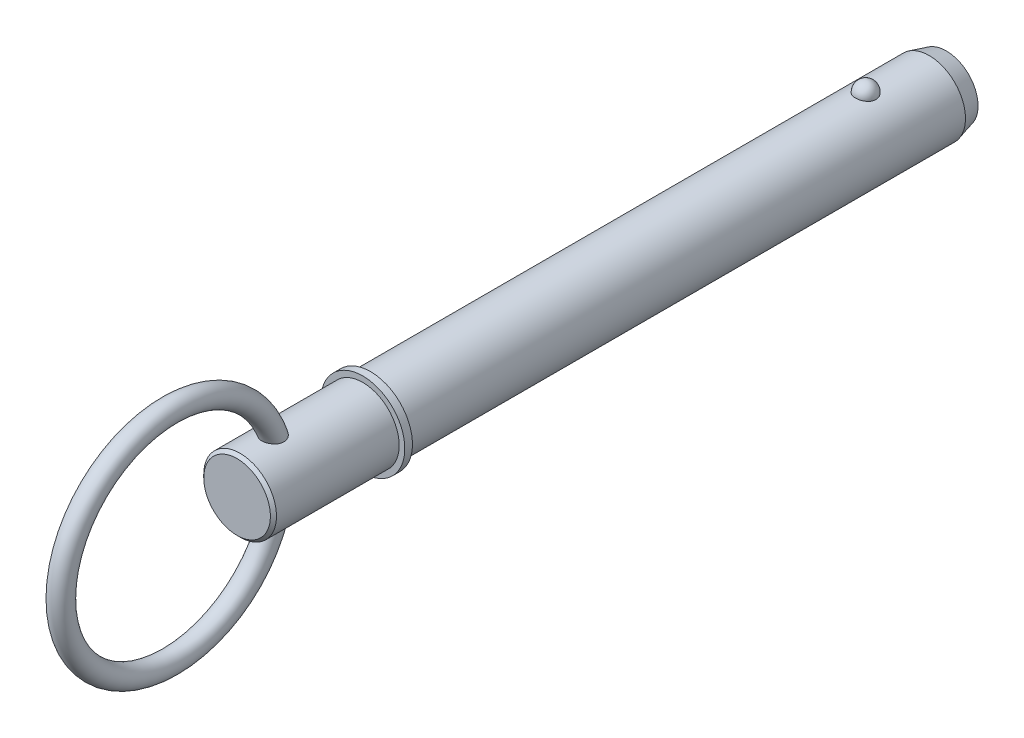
ISO-10303-21;
HEADER;
FILE_DESCRIPTION(('STEP AP214'),'2;1');
FILE_NAME('part.step','',(''),(''),'','','');
FILE_SCHEMA(('AUTOMOTIVE_DESIGN { 1 0 10303 214 1 1 1 1 }'));
ENDSEC;
DATA;
#1=APPLICATION_CONTEXT('core data for automotive mechanical design processes');
#2=APPLICATION_PROTOCOL_DEFINITION('international standard','automotive_design',2000,#1);
#3=PRODUCT_CONTEXT('',#1,'mechanical');
#4=PRODUCT('Part','Part','',(#3));
#5=PRODUCT_RELATED_PRODUCT_CATEGORY('part','',(#4));
#6=PRODUCT_DEFINITION_FORMATION('','',#4);
#7=PRODUCT_DEFINITION_CONTEXT('part definition',#1,'design');
#8=PRODUCT_DEFINITION('design','',#6,#7);
#9=PRODUCT_DEFINITION_SHAPE('','',#8);
#10=(LENGTH_UNIT() NAMED_UNIT(*) SI_UNIT(.MILLI.,.METRE.));
#11=(NAMED_UNIT(*) PLANE_ANGLE_UNIT() SI_UNIT($,.RADIAN.));
#12=(NAMED_UNIT(*) SI_UNIT($,.STERADIAN.) SOLID_ANGLE_UNIT());
#13=UNCERTAINTY_MEASURE_WITH_UNIT(LENGTH_MEASURE(1.E-05),#10,'distance_accuracy_value','');
#14=(GEOMETRIC_REPRESENTATION_CONTEXT(3) GLOBAL_UNCERTAINTY_ASSIGNED_CONTEXT((#13)) GLOBAL_UNIT_ASSIGNED_CONTEXT((#10,
#11,#12)) REPRESENTATION_CONTEXT('',''));
#15=CARTESIAN_POINT('',(0.,0.,0.));
#16=DIRECTION('',(0.,0.,1.));
#17=DIRECTION('',(1.,0.,0.));
#18=AXIS2_PLACEMENT_3D('',#15,#16,#17);
#19=CARTESIAN_POINT('',(0.,0.,127.));
#20=DIRECTION('',(0.,0.,-1.));
#21=DIRECTION('',(-1.,0.,0.));
#22=AXIS2_PLACEMENT_3D('',#19,#20,#21);
#23=CYLINDRICAL_SURFACE('',#22,9.525);
#24=CARTESIAN_POINT('',(2.66304631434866,9.14515223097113,-2.68999999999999));
#25=CARTESIAN_POINT('',(2.66304388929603,9.14515434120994,-2.53964785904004));
#26=CARTESIAN_POINT('',(2.65079171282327,9.14874785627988,-2.38926509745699));
#27=CARTESIAN_POINT('',(2.60207590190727,9.16272073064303,-2.09276319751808));
#28=CARTESIAN_POINT('',(2.5656035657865,9.17310252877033,-1.94664561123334));
#29=CARTESIAN_POINT('',(2.469373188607,9.19947238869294,-1.66290124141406));
#30=CARTESIAN_POINT('',(2.40962536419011,9.215457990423,-1.52527076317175));
#31=CARTESIAN_POINT('',(2.26832639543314,9.25124900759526,-1.26225231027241));
#32=CARTESIAN_POINT('',(2.1867756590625,9.27105435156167,-1.13686410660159));
#33=CARTESIAN_POINT('',(2.00344089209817,9.3123948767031,-0.901158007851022));
#34=CARTESIAN_POINT('',(1.90155748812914,9.33393823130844,-0.790918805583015));
#35=CARTESIAN_POINT('',(1.68043702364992,9.37626794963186,-0.589299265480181));
#36=CARTESIAN_POINT('',(1.56119995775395,9.397054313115,-0.497918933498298));
#37=CARTESIAN_POINT('',(1.30893044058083,9.43549335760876,-0.336812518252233));
#38=CARTESIAN_POINT('',(1.17593917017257,9.45315498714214,-0.267024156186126));
#39=CARTESIAN_POINT('',(0.8995966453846,9.48344056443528,-0.150749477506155));
#40=CARTESIAN_POINT('',(0.756246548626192,9.49606507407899,-0.104260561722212));
#41=CARTESIAN_POINT('',(0.466048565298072,9.51468193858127,-0.0365733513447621));
#42=CARTESIAN_POINT('',(0.319312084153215,9.52079100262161,-0.014929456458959));
#43=CARTESIAN_POINT('',(0.0241592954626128,9.52611235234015,0.00395337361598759));
#44=CARTESIAN_POINT('',(-0.124256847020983,9.5253253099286,0.00119468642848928));
#45=CARTESIAN_POINT('',(-0.41628168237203,9.51700443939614,-0.0284230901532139));
#46=CARTESIAN_POINT('',(-0.559928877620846,9.50956858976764,-0.0549321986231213));
#47=CARTESIAN_POINT('',(-0.840604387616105,9.48887888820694,-0.130816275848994));
#48=CARTESIAN_POINT('',(-0.977632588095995,9.47562493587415,-0.180191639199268));
#49=CARTESIAN_POINT('',(-1.24212223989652,9.44460733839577,-0.300803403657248));
#50=CARTESIAN_POINT('',(-1.36952298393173,9.42681774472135,-0.372166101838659));
#51=CARTESIAN_POINT('',(-1.61053183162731,9.38864858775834,-0.534729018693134));
#52=CARTESIAN_POINT('',(-1.72413851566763,9.36826875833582,-0.625931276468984));
#53=CARTESIAN_POINT('',(-1.9367483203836,9.32666137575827,-0.827716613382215));
#54=CARTESIAN_POINT('',(-2.03542624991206,9.3054250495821,-0.938640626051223));
#55=CARTESIAN_POINT('',(-2.21301001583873,9.26480083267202,-1.17562728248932));
#56=CARTESIAN_POINT('',(-2.29191442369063,9.24541307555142,-1.3016910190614));
#57=CARTESIAN_POINT('',(-2.4288038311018,9.21040769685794,-1.56709947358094));
#58=CARTESIAN_POINT('',(-2.48653332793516,9.19483682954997,-1.70658229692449));
#59=CARTESIAN_POINT('',(-2.57830950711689,9.16952722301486,-1.99363485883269));
#60=CARTESIAN_POINT('',(-2.61235688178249,9.1597883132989,-2.14120436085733));
#61=CARTESIAN_POINT('',(-2.65582131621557,9.14728131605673,-2.43957517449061));
#62=CARTESIAN_POINT('',(-2.66534248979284,9.14448376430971,-2.59036007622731));
#63=CARTESIAN_POINT('',(-2.659816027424,9.1460926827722,-2.89143694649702));
#64=CARTESIAN_POINT('',(-2.64476907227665,9.15049895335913,-3.04172892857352));
#65=CARTESIAN_POINT('',(-2.59062526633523,9.16597303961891,-3.3367616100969));
#66=CARTESIAN_POINT('',(-2.55165119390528,9.17700684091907,-3.48152666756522));
#67=CARTESIAN_POINT('',(-2.45072334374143,9.20447158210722,-3.7622672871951));
#68=CARTESIAN_POINT('',(-2.38876863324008,9.22090274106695,-3.89824249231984));
#69=CARTESIAN_POINT('',(-2.24300082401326,9.25744165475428,-4.15838266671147));
#70=CARTESIAN_POINT('',(-2.15906901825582,9.27756919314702,-4.28247834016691));
#71=CARTESIAN_POINT('',(-1.97161008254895,9.31920445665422,-4.51460755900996));
#72=CARTESIAN_POINT('',(-1.86808218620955,9.34071223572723,-4.62264047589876));
#73=CARTESIAN_POINT('',(-1.64365852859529,9.38280712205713,-4.82005417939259));
#74=CARTESIAN_POINT('',(-1.52269814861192,9.40339041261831,-4.90936239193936));
#75=CARTESIAN_POINT('',(-1.26696810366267,9.44124442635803,-5.06628635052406));
#76=CARTESIAN_POINT('',(-1.13219941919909,9.45851538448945,-5.13390363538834));
#77=CARTESIAN_POINT('',(-0.854427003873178,9.48761400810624,-5.24478918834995));
#78=CARTESIAN_POINT('',(-0.711548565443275,9.49950757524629,-5.28835378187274));
#79=CARTESIAN_POINT('',(-0.420167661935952,9.51684639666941,-5.35116010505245));
#80=CARTESIAN_POINT('',(-0.271665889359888,9.52229244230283,-5.3704048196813));
#81=CARTESIAN_POINT('',(0.0236961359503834,9.52609381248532,-5.38387805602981));
#82=CARTESIAN_POINT('',(0.170533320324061,9.52458300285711,-5.37857884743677));
#83=CARTESIAN_POINT('',(0.461166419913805,9.51494050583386,-5.34419624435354));
#84=CARTESIAN_POINT('',(0.604962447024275,9.50680906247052,-5.31511372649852));
#85=CARTESIAN_POINT('',(0.884899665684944,9.48484202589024,-5.23415185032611));
#86=CARTESIAN_POINT('',(1.02106863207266,9.47102889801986,-5.18236222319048));
#87=CARTESIAN_POINT('',(1.28268503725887,9.43915933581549,-5.05742910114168));
#88=CARTESIAN_POINT('',(1.40813178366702,9.421102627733,-4.98428422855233));
#89=CARTESIAN_POINT('',(1.64690915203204,9.38233399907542,-4.8172920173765));
#90=CARTESIAN_POINT('',(1.76002050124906,9.36158508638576,-4.72313982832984));
#91=CARTESIAN_POINT('',(1.96897358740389,9.31987907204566,-4.51732444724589));
#92=CARTESIAN_POINT('',(2.06481234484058,9.29892193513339,-4.40565824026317));
#93=CARTESIAN_POINT('',(2.23837433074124,9.25869342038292,-4.16566572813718));
#94=CARTESIAN_POINT('',(2.31574652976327,9.23945848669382,-4.03707931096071));
#95=CARTESIAN_POINT('',(2.44818540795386,9.20525491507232,-3.76840633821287));
#96=CARTESIAN_POINT('',(2.50325979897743,9.19028480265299,-3.6283237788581));
#97=CARTESIAN_POINT('',(2.58510224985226,9.16757716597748,-3.35610038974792));
#98=CARTESIAN_POINT('',(2.61427951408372,9.15923447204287,-3.2247283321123));
#99=CARTESIAN_POINT('',(2.6532524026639,9.14802112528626,-2.95891229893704));
#100=CARTESIAN_POINT('',(2.66304848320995,9.1451503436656,-2.82446839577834));
#101=CARTESIAN_POINT('',(2.66304631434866,9.14515223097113,-2.68999999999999));
#102=B_SPLINE_CURVE_WITH_KNOTS('',3,(#24,#25,#26,#27,#28,#29,#30,#31,#32,#33,#34,#35,#36,#37,
#38,#39,#40,#41,#42,#43,#44,#45,#46,#47,#48,#49,#50,#51,#52,#53,#54,#55,#56,#57,#58,#59,#60,#61,
#62,#63,#64,#65,#66,#67,#68,#69,#70,#71,#72,#73,#74,#75,#76,#77,#78,#79,#80,#81,#82,#83,#84,#85,
#86,#87,#88,#89,#90,#91,#92,#93,#94,#95,#96,#97,#98,#99,#100,#101),.UNSPECIFIED.,.T.,.F.,(4,2,2,
2,2,2,2,2,2,2,2,2,2,2,2,2,2,2,2,2,2,2,2,2,2,2,2,2,2,2,2,2,2,2,2,2,2,2,4),(0.,0.450573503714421,
0.901308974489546,1.35184682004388,1.80237623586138,2.25516399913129,2.70795190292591,
3.15942136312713,3.61084044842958,4.0540301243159,4.49717661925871,4.9338984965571,
5.37062791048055,5.80991423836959,6.24924573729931,6.69708004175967,7.1449466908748,
7.5980522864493,8.0511446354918,8.50231041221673,8.95346368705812,9.40232106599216,
9.85119666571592,10.3025487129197,10.7539184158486,11.2070064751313,11.6600623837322,
12.1074045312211,12.5546917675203,12.9934085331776,13.4321091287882,13.8690915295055,
14.3061021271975,14.7499227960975,15.1938199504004,15.6455814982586,16.0971866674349,
16.5001694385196,16.9031427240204),.UNSPECIFIED.);
#103=CARTESIAN_POINT('',(2.66304631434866,9.14515223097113,-2.68999999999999));
#104=VERTEX_POINT('',#103);
#105=EDGE_CURVE('E103',#104,#104,#102,.T.);
#106=ORIENTED_EDGE('',*,*,#105,.T.);
#107=EDGE_LOOP('',(#106));
#108=FACE_BOUND('',#107,.T.);
#109=CARTESIAN_POINT('',(0.,0.,-19.2999999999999));
#110=DIRECTION('',(0.,0.,-1.));
#111=DIRECTION('',(-1.,0.,0.));
#112=AXIS2_PLACEMENT_3D('',#109,#110,#111);
#113=CIRCLE('',#112,9.525);
#114=CARTESIAN_POINT('',(-9.525,0.,-19.2999999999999));
#115=VERTEX_POINT('',#114);
#116=EDGE_CURVE('E110',#115,#115,#113,.F.);
#117=ORIENTED_EDGE('',*,*,#116,.T.);
#118=EDGE_LOOP('',(#117));
#119=FACE_BOUND('',#118,.T.);
#120=CARTESIAN_POINT('',(0.,0.,127.));
#121=DIRECTION('',(0.,0.,1.));
#122=DIRECTION('',(1.,0.,0.));
#123=AXIS2_PLACEMENT_3D('',#120,#121,#122);
#124=CIRCLE('',#123,9.525);
#125=CARTESIAN_POINT('',(9.525,0.,127.));
#126=VERTEX_POINT('',#125);
#127=EDGE_CURVE('E108',#126,#126,#124,.T.);
#128=ORIENTED_EDGE('',*,*,#127,.F.);
#129=EDGE_LOOP('',(#128));
#130=FACE_BOUND('',#129,.T.);
#131=ADVANCED_FACE('F39',(#108,#119,#130),#23,.T.);
#132=CARTESIAN_POINT('',(0.,0.,-23.8));
#133=DIRECTION('',(0.,0.,-1.));
#134=DIRECTION('',(-1.,0.,0.));
#135=AXIS2_PLACEMENT_3D('',#132,#133,#134);
#136=PLANE('',#135);
#137=CARTESIAN_POINT('',(0.,0.,-23.8));
#138=DIRECTION('',(0.,0.,-1.));
#139=DIRECTION('',(-1.,0.,0.));
#140=AXIS2_PLACEMENT_3D('',#137,#138,#139);
#141=CIRCLE('',#140,8.31922863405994);
#142=CARTESIAN_POINT('',(-8.31922863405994,0.,-23.8));
#143=VERTEX_POINT('',#142);
#144=EDGE_CURVE('E142',#143,#143,#141,.T.);
#145=ORIENTED_EDGE('',*,*,#144,.T.);
#146=EDGE_LOOP('',(#145));
#147=FACE_BOUND('',#146,.T.);
#148=ADVANCED_FACE('F89',(#147),#136,.T.);
#149=CARTESIAN_POINT('',(0.,0.,-23.8));
#150=DIRECTION('',(0.,0.,1.));
#151=DIRECTION('',(1.,0.,0.));
#152=AXIS2_PLACEMENT_3D('',#149,#150,#151);
#153=CONICAL_SURFACE('',#152,8.31922863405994,0.261799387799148);
#154=ORIENTED_EDGE('',*,*,#116,.F.);
#155=EDGE_LOOP('',(#154));
#156=FACE_BOUND('',#155,.T.);
#157=ORIENTED_EDGE('',*,*,#144,.F.);
#158=EDGE_LOOP('',(#157));
#159=FACE_BOUND('',#158,.T.);
#160=ADVANCED_FACE('F95',(#156,#159),#153,.T.);
#161=CARTESIAN_POINT('',(0.,9.525,-2.68999999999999));
#162=DIRECTION('',(0.,1.,0.));
#163=DIRECTION('',(0.,0.,-1.));
#164=AXIS2_PLACEMENT_3D('',#161,#162,#163);
#165=SPHERICAL_SURFACE('',#164,2.69);
#166=ORIENTED_EDGE('',*,*,#105,.F.);
#167=EDGE_LOOP('',(#166));
#168=FACE_BOUND('',#167,.T.);
#169=ADVANCED_FACE('F113',(#168),#165,.T.);
#170=CARTESIAN_POINT('',(0.,0.,127.));
#171=DIRECTION('',(0.,0.,-1.));
#172=DIRECTION('',(-1.,0.,0.));
#173=AXIS2_PLACEMENT_3D('',#170,#171,#172);
#174=PLANE('',#173);
#175=ORIENTED_EDGE('',*,*,#127,.T.);
#176=EDGE_LOOP('',(#175));
#177=FACE_BOUND('',#176,.T.);
#178=CARTESIAN_POINT('',(0.,0.,127.));
#179=DIRECTION('',(0.,0.,-1.));
#180=DIRECTION('',(-1.,0.,0.));
#181=AXIS2_PLACEMENT_3D('',#178,#179,#180);
#182=CIRCLE('',#181,11.);
#183=CARTESIAN_POINT('',(-11.,0.,127.));
#184=VERTEX_POINT('',#183);
#185=EDGE_CURVE('E109',#184,#184,#182,.T.);
#186=ORIENTED_EDGE('',*,*,#185,.T.);
#187=EDGE_LOOP('',(#186));
#188=FACE_BOUND('',#187,.T.);
#189=ADVANCED_FACE('F117',(#177,#188),#174,.T.);
#190=CARTESIAN_POINT('',(0.,0.,33.7287874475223));
#191=DIRECTION('',(0.,0.,-1.));
#192=DIRECTION('',(-1.,0.,0.));
#193=AXIS2_PLACEMENT_3D('',#190,#191,#192);
#194=CYLINDRICAL_SURFACE('',#193,11.);
#195=CARTESIAN_POINT('',(0.,0.,129.));
#196=DIRECTION('',(0.,0.,-1.));
#197=DIRECTION('',(-1.,0.,0.));
#198=AXIS2_PLACEMENT_3D('',#195,#196,#197);
#199=CIRCLE('',#198,11.);
#200=CARTESIAN_POINT('',(-11.,0.,129.));
#201=VERTEX_POINT('',#200);
#202=EDGE_CURVE('E134',#201,#201,#199,.T.);
#203=ORIENTED_EDGE('',*,*,#202,.T.);
#204=EDGE_LOOP('',(#203));
#205=FACE_BOUND('',#204,.T.);
#206=ORIENTED_EDGE('',*,*,#185,.F.);
#207=EDGE_LOOP('',(#206));
#208=FACE_BOUND('',#207,.T.);
#209=ADVANCED_FACE('F121',(#205,#208),#194,.T.);
#210=CARTESIAN_POINT('',(0.,11.,129.));
#211=DIRECTION('',(0.,0.,1.));
#212=DIRECTION('',(1.,0.,0.));
#213=AXIS2_PLACEMENT_3D('',#210,#211,#212);
#214=PLANE('',#213);
#215=CARTESIAN_POINT('',(0.,0.,129.));
#216=DIRECTION('',(0.,0.,1.));
#217=DIRECTION('',(1.,0.,0.));
#218=AXIS2_PLACEMENT_3D('',#215,#216,#217);
#219=CIRCLE('',#218,9.525);
#220=CARTESIAN_POINT('',(9.525,0.,129.));
#221=VERTEX_POINT('',#220);
#222=EDGE_CURVE('E112',#221,#221,#219,.T.);
#223=ORIENTED_EDGE('',*,*,#222,.F.);
#224=EDGE_LOOP('',(#223));
#225=FACE_BOUND('',#224,.T.);
#226=ORIENTED_EDGE('',*,*,#202,.F.);
#227=EDGE_LOOP('',(#226));
#228=FACE_BOUND('',#227,.T.);
#229=ADVANCED_FACE('F86',(#225,#228),#214,.T.);
#230=CARTESIAN_POINT('',(0.,0.,161.93));
#231=DIRECTION('',(0.,0.,-1.));
#232=DIRECTION('',(-1.,0.,0.));
#233=AXIS2_PLACEMENT_3D('',#230,#231,#232);
#234=CYLINDRICAL_SURFACE('',#233,9.525);
#235=CARTESIAN_POINT('',(-1.17255022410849,-9.45255262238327,149.915681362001));
#236=CARTESIAN_POINT('',(-1.03279041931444,-9.46988901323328,149.852058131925));
#237=CARTESIAN_POINT('',(-0.887457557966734,-9.48474288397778,149.800036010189));
#238=CARTESIAN_POINT('',(-0.589790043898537,-9.50789357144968,149.720301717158));
#239=CARTESIAN_POINT('',(-0.437456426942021,-9.51619135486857,149.692585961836));
#240=CARTESIAN_POINT('',(-0.130095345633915,-9.52535230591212,149.662037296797));
#241=CARTESIAN_POINT('',(0.0249321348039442,-9.52621542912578,149.659204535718));
#242=CARTESIAN_POINT('',(0.333291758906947,-9.5204161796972,149.678480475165));
#243=CARTESIAN_POINT('',(0.486623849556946,-9.51375357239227,149.700589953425));
#244=CARTESIAN_POINT('',(0.78732615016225,-9.49360162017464,149.769309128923));
#245=CARTESIAN_POINT('',(0.934692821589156,-9.48010828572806,149.815933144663));
#246=CARTESIAN_POINT('',(1.21917062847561,-9.44773819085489,149.932695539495));
#247=CARTESIAN_POINT('',(1.35628163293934,-9.42886136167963,150.002834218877));
#248=CARTESIAN_POINT('',(1.61597534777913,-9.38783836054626,150.164858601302));
#249=CARTESIAN_POINT('',(1.73859309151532,-9.36570037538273,150.256690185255));
#250=CARTESIAN_POINT('',(1.96611924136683,-9.32059424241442,150.459983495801));
#251=CARTESIAN_POINT('',(2.07103000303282,-9.29762620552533,150.571442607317));
#252=CARTESIAN_POINT('',(2.25895856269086,-9.25375378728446,150.809567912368));
#253=CARTESIAN_POINT('',(2.34223089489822,-9.23282741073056,150.936029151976));
#254=CARTESIAN_POINT('',(2.48638570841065,-9.19505802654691,151.201654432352));
#255=CARTESIAN_POINT('',(2.54727152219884,-9.17821441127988,151.340816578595));
#256=CARTESIAN_POINT('',(2.64504150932,-9.15051673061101,151.626450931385));
#257=CARTESIAN_POINT('',(2.68213620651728,-9.13961026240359,151.77284631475));
#258=CARTESIAN_POINT('',(2.73308631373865,-9.1245038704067,152.069935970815));
#259=CARTESIAN_POINT('',(2.74693762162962,-9.12030513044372,152.220630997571));
#260=CARTESIAN_POINT('',(2.75225289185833,-9.11870262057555,152.528204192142));
#261=CARTESIAN_POINT('',(2.742835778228,-9.12156626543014,152.685097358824));
#262=CARTESIAN_POINT('',(2.70120500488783,-9.1339786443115,152.99553038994));
#263=CARTESIAN_POINT('',(2.66898313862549,-9.14352978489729,153.149069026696));
#264=CARTESIAN_POINT('',(2.57915721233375,-9.1692947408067,153.464317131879));
#265=CARTESIAN_POINT('',(2.51938387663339,-9.18606757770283,153.62536274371));
#266=CARTESIAN_POINT('',(2.37615490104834,-9.22415241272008,153.936112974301));
#267=CARTESIAN_POINT('',(2.29267648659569,-9.2454687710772,154.085806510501));
#268=CARTESIAN_POINT('',(2.09570343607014,-9.29218719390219,154.382005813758));
#269=CARTESIAN_POINT('',(1.98029238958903,-9.31778152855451,154.527215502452));
#270=CARTESIAN_POINT('',(1.72523060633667,-9.36835235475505,154.794631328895));
#271=CARTESIAN_POINT('',(1.58560973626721,-9.39332956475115,154.91686542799));
#272=CARTESIAN_POINT('',(1.31999418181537,-9.43381163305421,155.106542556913));
#273=CARTESIAN_POINT('',(1.1984987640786,-9.45016352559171,155.180111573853));
#274=CARTESIAN_POINT('',(0.944726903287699,-9.47889043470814,155.306555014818));
#275=CARTESIAN_POINT('',(0.812460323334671,-9.4912690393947,155.35944811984));
#276=CARTESIAN_POINT('',(0.539385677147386,-9.51070487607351,155.441579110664));
#277=CARTESIAN_POINT('',(0.398529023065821,-9.51772807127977,155.470665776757));
#278=CARTESIAN_POINT('',(0.113692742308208,-9.52538430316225,155.50234627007));
#279=CARTESIAN_POINT('',(-0.0302854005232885,-9.52602031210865,155.504952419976));
#280=CARTESIAN_POINT('',(-0.301067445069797,-9.52110324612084,155.484638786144));
#281=CARTESIAN_POINT('',(-0.428091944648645,-9.51619084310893,155.464361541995));
#282=CARTESIAN_POINT('',(-0.676960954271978,-9.50173118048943,155.403770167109));
#283=CARTESIAN_POINT('',(-0.79880468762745,-9.49218322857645,155.363453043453));
#284=CARTESIAN_POINT('',(-1.03743276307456,-9.4691126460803,155.263797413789));
#285=CARTESIAN_POINT('',(-1.15402581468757,-9.45550022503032,155.204026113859));
#286=CARTESIAN_POINT('',(-1.37707059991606,-9.42560278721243,155.068465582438));
#287=CARTESIAN_POINT('',(-1.48351822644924,-9.40931669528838,154.992669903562));
#288=CARTESIAN_POINT('',(-1.70022776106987,-9.37276249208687,154.815206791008));
#289=CARTESIAN_POINT('',(-1.80866644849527,-9.35226352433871,154.711363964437));
#290=CARTESIAN_POINT('',(-2.00947431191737,-9.31118474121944,154.48916467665));
#291=CARTESIAN_POINT('',(-2.10183201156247,-9.29060487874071,154.370797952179));
#292=CARTESIAN_POINT('',(-2.28343646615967,-9.24779116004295,154.101723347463));
#293=CARTESIAN_POINT('',(-2.36963977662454,-9.22584708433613,153.948904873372));
#294=CARTESIAN_POINT('',(-2.51731958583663,-9.18665215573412,153.631108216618));
#295=CARTESIAN_POINT('',(-2.57878214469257,-9.16940395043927,153.466123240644));
#296=CARTESIAN_POINT('',(-2.67771284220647,-9.14102404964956,153.117906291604));
#297=CARTESIAN_POINT('',(-2.71355979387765,-9.13031106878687,152.934171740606));
#298=CARTESIAN_POINT('',(-2.75239325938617,-9.11868499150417,152.562939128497));
#299=CARTESIAN_POINT('',(-2.75540326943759,-9.11776488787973,152.375443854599));
#300=CARTESIAN_POINT('',(-2.72755769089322,-9.12612848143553,152.018233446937));
#301=CARTESIAN_POINT('',(-2.69938579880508,-9.1346036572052,151.848293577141));
#302=CARTESIAN_POINT('',(-2.6128234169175,-9.15973790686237,151.51694195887));
#303=CARTESIAN_POINT('',(-2.5544530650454,-9.17639152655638,151.355524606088));
#304=CARTESIAN_POINT('',(-2.41575064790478,-9.21381352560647,151.062262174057));
#305=CARTESIAN_POINT('',(-2.33810564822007,-9.23402440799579,150.929067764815));
#306=CARTESIAN_POINT('',(-2.1611059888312,-9.27704240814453,150.678436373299));
#307=CARTESIAN_POINT('',(-2.06174995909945,-9.29984968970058,150.56100038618));
#308=CARTESIAN_POINT('',(-1.84046167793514,-9.34620233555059,150.341444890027));
#309=CARTESIAN_POINT('',(-1.71787459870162,-9.36974632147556,150.23998498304));
#310=CARTESIAN_POINT('',(-1.45637301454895,-9.41393415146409,150.060085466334));
#311=CARTESIAN_POINT('',(-1.31745717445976,-9.43457775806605,149.981647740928));
#312=CARTESIAN_POINT('',(-1.17255022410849,-9.45255262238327,149.915681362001));
#313=B_SPLINE_CURVE_WITH_KNOTS('',3,(#235,#236,#237,#238,#239,#240,#241,#242,#243,#244,#245,
#246,#247,#248,#249,#250,#251,#252,#253,#254,#255,#256,#257,#258,#259,#260,#261,#262,#263,#264,
#265,#266,#267,#268,#269,#270,#271,#272,#273,#274,#275,#276,#277,#278,#279,#280,#281,#282,#283,
#284,#285,#286,#287,#288,#289,#290,#291,#292,#293,#294,#295,#296,#297,#298,#299,#300,#301,#302,
#303,#304,#305,#306,#307,#308,#309,#310,#311,#312),.UNSPECIFIED.,.T.,.F.,(4,2,2,2,2,2,2,2,2,2,2,
2,2,2,2,2,2,2,2,2,2,2,2,2,2,2,2,2,2,2,2,2,2,2,2,2,2,2,4),(0.,0.463035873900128,
0.926003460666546,1.38897381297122,1.8519586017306,2.31521411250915,2.77847553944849,
3.24059321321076,3.70264936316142,4.15899535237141,4.61527338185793,5.06745604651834,
5.51971850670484,5.98936669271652,6.45918397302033,6.97482863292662,7.49097038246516,
8.04995658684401,8.60825803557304,9.03545685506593,9.462268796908,9.89177127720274,
10.3210738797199,10.7054535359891,11.0898906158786,11.4835430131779,11.8773540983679,
12.3302409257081,12.7834496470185,13.3116493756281,13.8401462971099,14.3996817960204,
14.9588168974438,15.4733264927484,15.9874934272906,16.4516692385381,16.915874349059,
17.3959238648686,17.8760126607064),.UNSPECIFIED.);
#314=CARTESIAN_POINT('',(-1.17255022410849,-9.45255262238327,149.915681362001));
#315=VERTEX_POINT('',#314);
#316=EDGE_CURVE('E10',#315,#315,#313,.T.);
#317=ORIENTED_EDGE('',*,*,#316,.F.);
#318=EDGE_LOOP('',(#317));
#319=FACE_BOUND('',#318,.T.);
#320=CARTESIAN_POINT('',(-1.17255022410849,9.45255262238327,149.915681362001));
#321=CARTESIAN_POINT('',(-1.31058061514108,9.43543238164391,149.978514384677));
#322=CARTESIAN_POINT('',(-1.44315063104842,9.41589375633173,150.052651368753));
#323=CARTESIAN_POINT('',(-1.69365345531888,9.37407591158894,150.221892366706));
#324=CARTESIAN_POINT('',(-1.81158925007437,9.35179725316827,150.316992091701));
#325=CARTESIAN_POINT('',(-2.02956633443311,9.30692788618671,150.52596768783));
#326=CARTESIAN_POINT('',(-2.12959463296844,9.28433696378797,150.639857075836));
#327=CARTESIAN_POINT('',(-2.30883055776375,9.24139869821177,150.88334578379));
#328=CARTESIAN_POINT('',(-2.38804080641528,9.22105107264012,151.012943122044));
#329=CARTESIAN_POINT('',(-2.52289811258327,9.18506690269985,151.282637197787));
#330=CARTESIAN_POINT('',(-2.57879510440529,9.16938093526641,151.422602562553));
#331=CARTESIAN_POINT('',(-2.66732862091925,9.14402087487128,151.710194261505));
#332=CARTESIAN_POINT('',(-2.6999643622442,9.13434698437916,151.857820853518));
#333=CARTESIAN_POINT('',(-2.74234854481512,9.12171311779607,152.158709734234));
#334=CARTESIAN_POINT('',(-2.75176419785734,9.11885078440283,152.312022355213));
#335=CARTESIAN_POINT('',(-2.74768995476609,9.12007747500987,152.618282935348));
#336=CARTESIAN_POINT('',(-2.73419331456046,9.12416854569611,152.771230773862));
#337=CARTESIAN_POINT('',(-2.6838140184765,9.13911977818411,153.085048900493));
#338=CARTESIAN_POINT('',(-2.64520186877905,9.15047943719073,153.245615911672));
#339=CARTESIAN_POINT('',(-2.54485320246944,9.17889121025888,153.558878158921));
#340=CARTESIAN_POINT('',(-2.48309922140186,9.19594762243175,153.711567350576));
#341=CARTESIAN_POINT('',(-2.33056913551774,9.23584987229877,154.021122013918));
#342=CARTESIAN_POINT('',(-2.23745101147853,9.25911216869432,154.176784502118));
#343=CARTESIAN_POINT('',(-2.02674425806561,9.307501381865,154.470279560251));
#344=CARTESIAN_POINT('',(-1.90916388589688,9.33262766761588,154.608118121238));
#345=CARTESIAN_POINT('',(-1.67044606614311,9.37804498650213,154.842015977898));
#346=CARTESIAN_POINT('',(-1.55243875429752,9.39849934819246,154.941240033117));
#347=CARTESIAN_POINT('',(-1.30125310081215,9.43654625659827,155.119193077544));
#348=CARTESIAN_POINT('',(-1.16808326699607,9.45414039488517,155.197933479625));
#349=CARTESIAN_POINT('',(-0.958516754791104,9.47691412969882,155.297606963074));
#350=CARTESIAN_POINT('',(-0.886649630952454,9.48392776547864,155.327860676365));
#351=CARTESIAN_POINT('',(-0.740281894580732,9.49647248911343,155.381484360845));
#352=CARTESIAN_POINT('',(-0.665782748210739,9.50200438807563,155.404858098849));
#353=CARTESIAN_POINT('',(-0.514804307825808,9.51137811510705,155.4442294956));
#354=CARTESIAN_POINT('',(-0.438326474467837,9.51522115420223,155.460232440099));
#355=CARTESIAN_POINT('',(-0.284116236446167,9.52107513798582,155.484532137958));
#356=CARTESIAN_POINT('',(-0.206384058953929,9.52308641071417,155.492830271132));
#357=CARTESIAN_POINT('',(0.00463957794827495,9.5259225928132,155.50454519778));
#358=CARTESIAN_POINT('',(0.1384605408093,9.52491109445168,155.500394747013));
#359=CARTESIAN_POINT('',(0.40315259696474,9.51738801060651,155.469251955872));
#360=CARTESIAN_POINT('',(0.53402383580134,9.51087669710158,155.442260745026));
#361=CARTESIAN_POINT('',(0.783985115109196,9.49347484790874,155.368806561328));
#362=CARTESIAN_POINT('',(0.903337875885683,9.48277338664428,155.323181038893));
#363=CARTESIAN_POINT('',(1.1336366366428,9.45800893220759,155.214928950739));
#364=CARTESIAN_POINT('',(1.24458027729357,9.44394500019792,155.152297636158));
#365=CARTESIAN_POINT('',(1.46880911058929,9.41182796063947,155.004389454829));
#366=CARTESIAN_POINT('',(1.58087386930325,9.3935013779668,154.917328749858));
#367=CARTESIAN_POINT('',(1.79132420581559,9.35565274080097,154.728247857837));
#368=CARTESIAN_POINT('',(1.88970126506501,9.33612995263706,154.626218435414));
#369=CARTESIAN_POINT('',(2.08778125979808,9.29401761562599,154.390997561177));
#370=CARTESIAN_POINT('',(2.18473298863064,9.27148591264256,154.25547341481));
#371=CARTESIAN_POINT('',(2.35733954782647,9.22911075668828,153.971030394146));
#372=CARTESIAN_POINT('',(2.43297838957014,9.20926932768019,153.822101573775));
#373=CARTESIAN_POINT('',(2.56843139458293,9.17247322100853,153.497269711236));
#374=CARTESIAN_POINT('',(2.6256192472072,9.15606955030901,153.320196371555));
#375=CARTESIAN_POINT('',(2.70930664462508,9.13166037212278,152.958330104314));
#376=CARTESIAN_POINT('',(2.73581406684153,9.12365270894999,152.773539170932));
#377=CARTESIAN_POINT('',(2.7551261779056,9.11784049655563,152.409017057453));
#378=CARTESIAN_POINT('',(2.74917791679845,9.11965839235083,152.229361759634));
#379=CARTESIAN_POINT('',(2.70473277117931,9.13294027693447,151.874499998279));
#380=CARTESIAN_POINT('',(2.66626406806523,9.14439591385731,151.699289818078));
#381=CARTESIAN_POINT('',(2.56263844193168,9.17393184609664,151.378469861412));
#382=CARTESIAN_POINT('',(2.50080069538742,9.19116614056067,151.231704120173));
#383=CARTESIAN_POINT('',(2.35244847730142,9.23024728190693,150.95189992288));
#384=CARTESIAN_POINT('',(2.26593972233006,9.25209305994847,150.818858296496));
#385=CARTESIAN_POINT('',(2.07585352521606,9.29652853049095,150.577145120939));
#386=CARTESIAN_POINT('',(1.97340753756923,9.31901931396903,150.467562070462));
#387=CARTESIAN_POINT('',(1.75142335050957,9.36327537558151,150.267179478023));
#388=CARTESIAN_POINT('',(1.63188535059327,9.38504066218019,150.176379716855));
#389=CARTESIAN_POINT('',(1.37826267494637,9.42563474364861,150.015168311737));
#390=CARTESIAN_POINT('',(1.24409194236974,9.44444438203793,149.944887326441));
#391=CARTESIAN_POINT('',(0.965562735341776,9.47697010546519,149.826996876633));
#392=CARTESIAN_POINT('',(0.821203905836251,9.4906860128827,149.779388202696));
#393=CARTESIAN_POINT('',(0.524366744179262,9.51173338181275,149.707369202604));
#394=CARTESIAN_POINT('',(0.371807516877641,9.5189799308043,149.683267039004));
#395=CARTESIAN_POINT('',(0.0646112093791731,9.52602042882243,149.659842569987));
#396=CARTESIAN_POINT('',(-0.0900262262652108,9.52581308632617,149.660524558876));
#397=CARTESIAN_POINT('',(-0.404139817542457,9.51777767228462,149.687276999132));
#398=CARTESIAN_POINT('',(-0.563508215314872,9.50959696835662,149.714522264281));
#399=CARTESIAN_POINT('',(-0.874799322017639,9.48602809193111,149.795533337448));
#400=CARTESIAN_POINT('',(-1.02672214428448,9.47064002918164,149.84929874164));
#401=CARTESIAN_POINT('',(-1.17255022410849,9.45255262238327,149.915681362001));
#402=B_SPLINE_CURVE_WITH_KNOTS('',3,(#320,#321,#322,#323,#324,#325,#326,#327,#328,#329,#330,
#331,#332,#333,#334,#335,#336,#337,#338,#339,#340,#341,#342,#343,#344,#345,#346,#347,#348,#349,
#350,#351,#352,#353,#354,#355,#356,#357,#358,#359,#360,#361,#362,#363,#364,#365,#366,#367,#368,
#369,#370,#371,#372,#373,#374,#375,#376,#377,#378,#379,#380,#381,#382,#383,#384,#385,#386,#387,
#388,#389,#390,#391,#392,#393,#394,#395,#396,#397,#398,#399,#400,#401),.UNSPECIFIED.,.T.,.F.,(4,
2,2,2,2,2,2,2,2,2,2,2,2,2,2,2,2,2,2,2,2,2,2,2,2,2,2,2,2,2,2,2,2,2,2,2,2,2,2,2,4),(0.,
0.457306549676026,0.914519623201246,1.37206305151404,1.82954881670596,2.28199545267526,
2.73445732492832,3.19336710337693,3.65241198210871,4.14699278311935,4.64194758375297,
5.18812269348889,5.73411374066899,6.19889752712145,6.66342179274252,6.89799214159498,
7.13243382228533,7.36670711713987,7.60093844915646,8.00032434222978,8.39969048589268,
8.78279802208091,9.16601265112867,9.59366701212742,10.0215863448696,10.5240084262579,
11.0268064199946,11.5844522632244,12.1419548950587,12.6781910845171,13.213963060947,
13.6920531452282,14.1700325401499,14.6229745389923,15.0759112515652,15.5316722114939,
15.9874490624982,16.4491237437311,16.91087841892,17.3940267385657,17.8771677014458),.UNSPECIFIED.);
#403=CARTESIAN_POINT('',(-1.17255022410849,9.45255262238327,149.915681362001));
#404=VERTEX_POINT('',#403);
#405=EDGE_CURVE('E51',#404,#404,#402,.T.);
#406=ORIENTED_EDGE('',*,*,#405,.F.);
#407=EDGE_LOOP('',(#406));
#408=FACE_BOUND('',#407,.T.);
#409=CARTESIAN_POINT('',(0.,0.,161.13));
#410=DIRECTION('',(0.,0.,-1.));
#411=DIRECTION('',(-1.,0.,0.));
#412=AXIS2_PLACEMENT_3D('',#409,#410,#411);
#413=CIRCLE('',#412,9.525);
#414=CARTESIAN_POINT('',(-9.525,0.,161.13));
#415=VERTEX_POINT('',#414);
#416=EDGE_CURVE('E65',#415,#415,#413,.T.);
#417=ORIENTED_EDGE('',*,*,#416,.T.);
#418=EDGE_LOOP('',(#417));
#419=FACE_BOUND('',#418,.T.);
#420=ORIENTED_EDGE('',*,*,#222,.T.);
#421=EDGE_LOOP('',(#420));
#422=FACE_BOUND('',#421,.T.);
#423=ADVANCED_FACE('F70',(#319,#408,#419,#422),#234,.T.);
#424=CARTESIAN_POINT('',(0.,0.,161.93));
#425=DIRECTION('',(0.,0.,-1.));
#426=DIRECTION('',(-1.,0.,0.));
#427=AXIS2_PLACEMENT_3D('',#424,#425,#426);
#428=PLANE('',#427);
#429=CARTESIAN_POINT('',(0.,0.,161.93));
#430=DIRECTION('',(0.,0.,-1.));
#431=DIRECTION('',(-1.,0.,0.));
#432=AXIS2_PLACEMENT_3D('',#429,#430,#431);
#433=CIRCLE('',#432,8.72499999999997);
#434=CARTESIAN_POINT('',(-8.72499999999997,0.,161.93));
#435=VERTEX_POINT('',#434);
#436=EDGE_CURVE('E58',#435,#435,#433,.F.);
#437=ORIENTED_EDGE('',*,*,#436,.T.);
#438=EDGE_LOOP('',(#437));
#439=FACE_BOUND('',#438,.T.);
#440=ADVANCED_FACE('F77',(#439),#428,.F.);
#441=CARTESIAN_POINT('',(0.,0.,161.13));
#442=DIRECTION('',(0.,0.,-1.));
#443=DIRECTION('',(-1.,0.,0.));
#444=AXIS2_PLACEMENT_3D('',#441,#442,#443);
#445=CONICAL_SURFACE('',#444,9.525,0.785398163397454);
#446=ORIENTED_EDGE('',*,*,#436,.F.);
#447=EDGE_LOOP('',(#446));
#448=FACE_BOUND('',#447,.T.);
#449=ORIENTED_EDGE('',*,*,#416,.F.);
#450=EDGE_LOOP('',(#449));
#451=FACE_BOUND('',#450,.T.);
#452=ADVANCED_FACE('F41',(#448,#451),#445,.T.);
#453=CARTESIAN_POINT('',(0.,0.,179.505));
#454=DIRECTION('',(1.,0.,0.));
#455=DIRECTION('',(0.,0.,-1.));
#456=AXIS2_PLACEMENT_3D('',#453,#454,#455);
#457=TOROIDAL_SURFACE('',#456,28.575,2.75);
#458=ORIENTED_EDGE('',*,*,#316,.T.);
#459=EDGE_LOOP('',(#458));
#460=FACE_BOUND('',#459,.T.);
#461=ORIENTED_EDGE('',*,*,#405,.T.);
#462=EDGE_LOOP('',(#461));
#463=FACE_BOUND('',#462,.T.);
#464=ADVANCED_FACE('F74',(#460,#463),#457,.T.);
#465=CLOSED_SHELL('',(#131,#148,#160,#169,#189,#209,#229,#423,#440,#452,#464));
#466=MANIFOLD_SOLID_BREP('B2',#465);
#467=ADVANCED_BREP_SHAPE_REPRESENTATION('',(#18,#466),#14);
#468=SHAPE_DEFINITION_REPRESENTATION(#9,#467);
ENDSEC;
END-ISO-10303-21;
